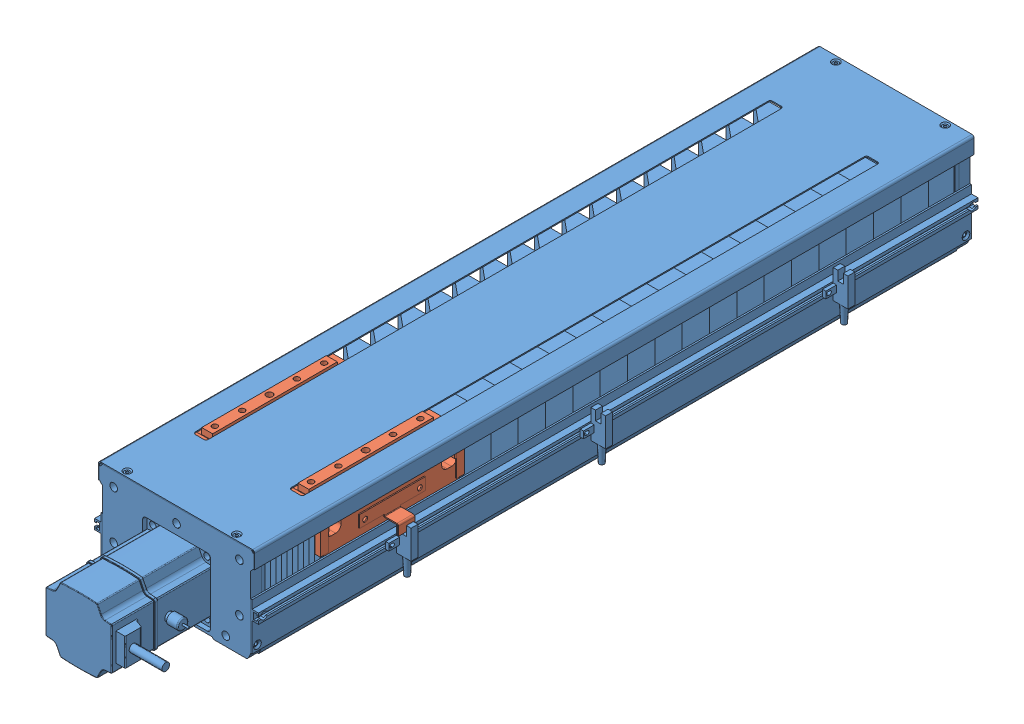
SolidWorks assembly 装配体8.sldasm, configuration 默认 (file format 9000). Lengths in mm.
Overall size (163.4 91 747.5).
2 component instances, 2 part files, 3 mates.
Components (placement in the parent):
- TCD135PS400-风琴罩滑台-1: TCD135PS400-风琴罩滑台.SLDPRT [默认] at (398.815 276.6953 520.7151) size (163.4 89.5 747.5)
- TCD135PS100-滑台-1: TCD135PS100-滑台.SLDPRT [默认] at (398.815 276.6953 670.7151) size (150 75.5 138)
Mates (geometry in assembly coordinates):
- 同心1: concentric anti-aligned: cylinder of TCD135PS400-风琴罩滑台-1 through (398.815 312.1953 802.2151) axis (0 0 1) radius 8; cylinder of TCD135PS100-滑台-1 through (398.815 312.1953 785.7151) axis (0 0 -1) radius 14.25
- 平行1: parallel aligned: plane of TCD135PS400-风琴罩滑台-1 through (398.815 366.1953 520.7151) normal (0 1 0); plane of TCD135PS100-滑台-1 through (299.315 362.1953 663.7151) normal (0 1 0)
- LimitDistance1: limit distance = 12 mm anti-aligned: plane of TCD135PS100-滑台-1 through (398.815 308.1953 740.7151) normal (0 0 1); plane of TCD135PS400-风琴罩滑台-1 through (363.315 312.1953 752.7151) normal (0 0 -1)
